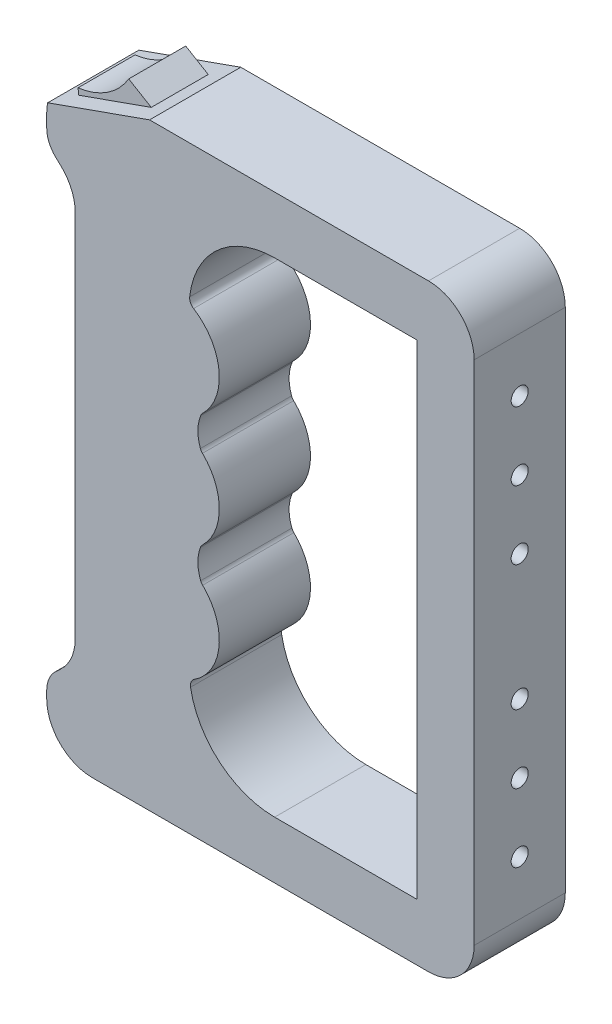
from build123d import *

# Parameters (mm, degrees)
BOSS_EXTRU_1_DEPTH      = 8
BOSS_EXTRU_2_DEPTH      = 5
ESQUISSE3_R             = 1.5
ENL_V_MAT_EXTRU_1_DEPTH = 5
ESQUISSE5_R             = 2
ESQUISSE5_W             = 3.723879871
ESQUISSE5_H             = 4
ENL_V_MAT_EXTRU_2_DEPTH = 18


with BuildPart() as part:
    # Esquisse1 → Boss.-Extru.1 (new, symmetric)
    with BuildSketch(Plane.XY):
        with BuildLine():
            Line((-51.144091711, 39.249304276), (-2.196939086, 39.249304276))
            ThreePointArc((-2.196939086, 39.249304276), (3.459915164, 36.906158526), (5.803060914, 31.249304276))
            Line((5.803060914, 31.249304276), (5.803060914, -57.750695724))
            ThreePointArc((5.803060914, -57.750695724), (3.459915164, -63.407549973), (-2.196939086, -65.750695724))
            Line((-2.196939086, -65.750695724), (-61.196939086, -65.750695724))
            ThreePointArc((-61.196939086, -65.750695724), (-66.853793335, -63.407549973), (-69.196939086, -57.750695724))
            Line((-69.196939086, -57.750695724), (-69.196939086, -56.47302825))
            ThreePointArc((-69.196939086, -56.47302825), (-68.781701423, -54.478045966), (-67.604957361, -52.814420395))
            Line((-67.604957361, -52.814420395), (-66.744109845, -52.012535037))
            ThreePointArc((-66.744109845, -52.012535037), (-64.861319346, -49.350734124), (-64.196939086, -46.15876247))
            Line((-64.196939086, -46.15876247), (-64.196939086, 18.657371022))
            ThreePointArc((-64.196939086, 18.657371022), (-64.861319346, 21.849342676), (-66.744109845, 24.51114359))
            Line((-66.744109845, 24.51114359), (-67.604957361, 25.313028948))
            ThreePointArc((-67.604957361, 25.313028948), (-68.781701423, 26.976654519), (-69.196939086, 28.971636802))
            Line((-69.196939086, 28.971636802), (-69.196939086, 31.249304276))
            ThreePointArc((-69.196939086, 31.249304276), (-69.153199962, 32.084716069), (-69.02246087, 32.910992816))
            Line((-69.02246087, 32.910992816), (-51.144091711, 39.249304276))
        make_face()
        with BuildLine():
            Line((-29.196939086, 29.249304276), (-4.196939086, 29.249304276))
            Line((-4.196939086, 29.249304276), (-4.196939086, -55.750695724))
            Line((-4.196939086, -55.750695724), (-29.196939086, -55.750695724))
            ThreePointArc((-29.196939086, -55.750695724), (-38.82705747, -52.251166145), (-43.963724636, -43.385471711))
            ThreePointArc((-43.963724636, -43.385471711), (-43.863899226, -42.526783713), (-43.306768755, -41.865787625))
            ThreePointArc((-43.306768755, -41.865787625), (-38.958536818, -34.697415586), (-41.829748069, -26.820307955))
            ThreePointArc((-41.829748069, -26.820307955), (-42.029612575, -26.579313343), (-42.175096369, -26.302079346))
            ThreePointArc((-42.175096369, -26.302079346), (-42.669766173, -23.788060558), (-42.224728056, -21.264782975))
            ThreePointArc((-42.224728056, -21.264782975), (-42.074727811, -20.969268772), (-41.863498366, -20.713904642))
            ThreePointArc((-41.863498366, -20.713904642), (-38.912178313, -13.750695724), (-41.863498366, -6.787486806))
            ThreePointArc((-41.863498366, -6.787486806), (-42.074727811, -6.532122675), (-42.224728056, -6.236608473))
            ThreePointArc((-42.224728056, -6.236608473), (-42.669766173, -3.71333089), (-42.175096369, -1.199312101))
            ThreePointArc((-42.175096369, -1.199312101), (-42.029612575, -0.922078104), (-41.829748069, -0.681083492))
            ThreePointArc((-41.829748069, -0.681083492), (-38.965367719, 7.263198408), (-43.420372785, 14.43740356))
            ThreePointArc((-43.420372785, 14.43740356), (-43.969381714, 15.053447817), (-44.109491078, 15.866645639))
            ThreePointArc((-44.109491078, 15.866645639), (-39.215419, 25.413087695), (-29.196939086, 29.249304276))
        make_face(mode=Mode.SUBTRACT)
    extrude(amount=BOSS_EXTRU_1_DEPTH, both=True)

    # Esquisse2 → Boss.-Extru.2 (add, symmetric)
    with BuildSketch(Plane.XY):
        with BuildLine():
            Line((-66.703299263, 34.843273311), (-66.012057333, 29.206992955))
            Line((-66.012057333, 29.206992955), (-51.721015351, 37.017213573))
            Line((-51.721015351, 37.017213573), (-57.80566854, 40.643421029))
            ThreePointArc((-57.80566854, 40.643421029), (-61.582084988, 36.711863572), (-66.703299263, 34.843273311))
        make_face()
    extrude(amount=BOSS_EXTRU_2_DEPTH, both=True)

    # Esquisse3 → Enl_v. mat.-Extru.1 (cut)
    with BuildSketch(Plane(origin=(5.803060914, 0, 0), x_dir=(0, 0, -1), z_dir=(1, 0, 0))):
        with Locations(Location((0, -24.270166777, 0), (0, 0, 90))):
            Circle(ESQUISSE3_R)
        with Locations(Location((0, -36.270166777, 0), (0, 0, 90))):
            Circle(ESQUISSE3_R)
        with Locations(Location((0, -48.270166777, 0), (0, 0, 90))):
            Circle(ESQUISSE3_R)
        with Locations(Location((0, 21.768775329, 0), (0, 0, 270))):
            Circle(ESQUISSE3_R)
        with Locations(Location((0, 9.768775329, 0), (0, 0, 270))):
            Circle(ESQUISSE3_R)
        with Locations(Location((0, -2.231224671, 0), (0, 0, 270))):
            Circle(ESQUISSE3_R)
    extrude(amount=-ENL_V_MAT_EXTRU_1_DEPTH, mode=Mode.SUBTRACT)

    # Esquisse5 → Enl_v. mat.-Extru.2 (cut)
    with BuildSketch(Plane.XZ.offset(65.750695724)):
        with Locations(Location((-58.685514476, 0, 0), (0, 0, 270))):
            Circle(ESQUISSE5_R)
        with Locations((-54.356504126, 0)):
            Rectangle(ESQUISSE5_W, ESQUISSE5_H)
    extrude(amount=-ENL_V_MAT_EXTRU_2_DEPTH, mode=Mode.SUBTRACT)


solid = part.part
